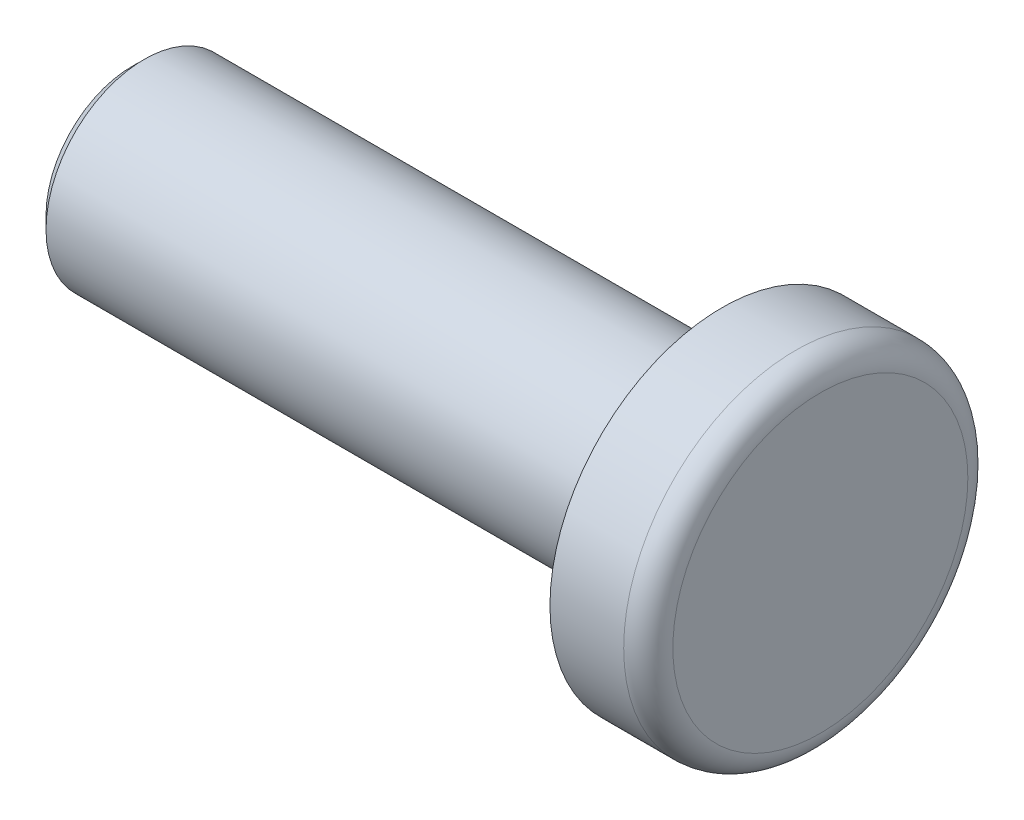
ISO-10303-21;
HEADER;
FILE_DESCRIPTION(('STEP AP214'),'2;1');
FILE_NAME('part.step','',(''),(''),'','','');
FILE_SCHEMA(('AUTOMOTIVE_DESIGN { 1 0 10303 214 1 1 1 1 }'));
ENDSEC;
DATA;
#1=APPLICATION_CONTEXT('core data for automotive mechanical design processes');
#2=APPLICATION_PROTOCOL_DEFINITION('international standard','automotive_design',2000,#1);
#3=PRODUCT_CONTEXT('',#1,'mechanical');
#4=PRODUCT('Part','Part','',(#3));
#5=PRODUCT_RELATED_PRODUCT_CATEGORY('part','',(#4));
#6=PRODUCT_DEFINITION_FORMATION('','',#4);
#7=PRODUCT_DEFINITION_CONTEXT('part definition',#1,'design');
#8=PRODUCT_DEFINITION('design','',#6,#7);
#9=PRODUCT_DEFINITION_SHAPE('','',#8);
#10=(LENGTH_UNIT() NAMED_UNIT(*) SI_UNIT(.MILLI.,.METRE.));
#11=(NAMED_UNIT(*) PLANE_ANGLE_UNIT() SI_UNIT($,.RADIAN.));
#12=(NAMED_UNIT(*) SI_UNIT($,.STERADIAN.) SOLID_ANGLE_UNIT());
#13=UNCERTAINTY_MEASURE_WITH_UNIT(LENGTH_MEASURE(1.E-05),#10,'distance_accuracy_value','');
#14=(GEOMETRIC_REPRESENTATION_CONTEXT(3) GLOBAL_UNCERTAINTY_ASSIGNED_CONTEXT((#13)) GLOBAL_UNIT_ASSIGNED_CONTEXT((#10,
#11,#12)) REPRESENTATION_CONTEXT('',''));
#15=CARTESIAN_POINT('',(0.,0.,0.));
#16=DIRECTION('',(0.,0.,1.));
#17=DIRECTION('',(1.,0.,0.));
#18=AXIS2_PLACEMENT_3D('',#15,#16,#17);
#19=CARTESIAN_POINT('',(0.,0.,0.));
#20=DIRECTION('',(1.,0.,0.));
#21=DIRECTION('',(0.,0.,-1.));
#22=AXIS2_PLACEMENT_3D('',#19,#20,#21);
#23=PLANE('',#22);
#24=CARTESIAN_POINT('',(0.,0.,0.));
#25=DIRECTION('',(1.,0.,0.));
#26=DIRECTION('',(0.,0.,-1.));
#27=AXIS2_PLACEMENT_3D('',#24,#25,#26);
#28=CIRCLE('',#27,3.5);
#29=CARTESIAN_POINT('',(0.,0.,-3.5));
#30=VERTEX_POINT('',#29);
#31=EDGE_CURVE('E52',#30,#30,#28,.T.);
#32=ORIENTED_EDGE('',*,*,#31,.F.);
#33=EDGE_LOOP('',(#32));
#34=FACE_BOUND('',#33,.T.);
#35=CARTESIAN_POINT('',(0.,0.,0.));
#36=DIRECTION('',(1.,0.,0.));
#37=DIRECTION('',(0.,0.,-1.));
#38=AXIS2_PLACEMENT_3D('',#35,#36,#37);
#39=CIRCLE('',#38,2.);
#40=CARTESIAN_POINT('',(0.,0.,-2.));
#41=VERTEX_POINT('',#40);
#42=EDGE_CURVE('E49',#41,#41,#39,.F.);
#43=ORIENTED_EDGE('',*,*,#42,.F.);
#44=EDGE_LOOP('',(#43));
#45=FACE_BOUND('',#44,.T.);
#46=ADVANCED_FACE('F29',(#34,#45),#23,.F.);
#47=CARTESIAN_POINT('',(2.,0.,0.));
#48=DIRECTION('',(-1.,0.,0.));
#49=DIRECTION('',(0.,0.,1.));
#50=AXIS2_PLACEMENT_3D('',#47,#48,#49);
#51=CYLINDRICAL_SURFACE('',#50,3.5);
#52=CARTESIAN_POINT('',(1.5,0.,0.));
#53=DIRECTION('',(1.,0.,0.));
#54=DIRECTION('',(0.,0.,-1.));
#55=AXIS2_PLACEMENT_3D('',#52,#53,#54);
#56=CIRCLE('',#55,3.5);
#57=CARTESIAN_POINT('',(1.5,0.,-3.5));
#58=VERTEX_POINT('',#57);
#59=EDGE_CURVE('E10',#58,#58,#56,.F.);
#60=ORIENTED_EDGE('',*,*,#59,.T.);
#61=EDGE_LOOP('',(#60));
#62=FACE_BOUND('',#61,.T.);
#63=ORIENTED_EDGE('',*,*,#31,.T.);
#64=EDGE_LOOP('',(#63));
#65=FACE_BOUND('',#64,.T.);
#66=ADVANCED_FACE('F56',(#62,#65),#51,.T.);
#67=CARTESIAN_POINT('',(2.,0.,0.));
#68=DIRECTION('',(1.,0.,0.));
#69=DIRECTION('',(0.,0.,-1.));
#70=AXIS2_PLACEMENT_3D('',#67,#68,#69);
#71=PLANE('',#70);
#72=CARTESIAN_POINT('',(2.,0.,0.));
#73=DIRECTION('',(1.,0.,0.));
#74=DIRECTION('',(0.,0.,-1.));
#75=AXIS2_PLACEMENT_3D('',#72,#73,#74);
#76=CIRCLE('',#75,3.);
#77=CARTESIAN_POINT('',(2.,0.,-3.));
#78=VERTEX_POINT('',#77);
#79=EDGE_CURVE('E36',#78,#78,#76,.T.);
#80=ORIENTED_EDGE('',*,*,#79,.T.);
#81=EDGE_LOOP('',(#80));
#82=FACE_BOUND('',#81,.T.);
#83=ADVANCED_FACE('F66',(#82),#71,.T.);
#84=CARTESIAN_POINT('',(-12.,0.,0.));
#85=DIRECTION('',(1.,0.,0.));
#86=DIRECTION('',(0.,0.,-1.));
#87=AXIS2_PLACEMENT_3D('',#84,#85,#86);
#88=CYLINDRICAL_SURFACE('',#87,2.);
#89=CARTESIAN_POINT('',(-11.75,0.,0.));
#90=DIRECTION('',(-1.,0.,0.));
#91=DIRECTION('',(0.,0.,1.));
#92=AXIS2_PLACEMENT_3D('',#89,#90,#91);
#93=CIRCLE('',#92,2.);
#94=CARTESIAN_POINT('',(-11.75,0.,2.));
#95=VERTEX_POINT('',#94);
#96=EDGE_CURVE('E40',#95,#95,#93,.F.);
#97=ORIENTED_EDGE('',*,*,#96,.T.);
#98=EDGE_LOOP('',(#97));
#99=FACE_BOUND('',#98,.T.);
#100=ORIENTED_EDGE('',*,*,#42,.T.);
#101=EDGE_LOOP('',(#100));
#102=FACE_BOUND('',#101,.T.);
#103=ADVANCED_FACE('F63',(#99,#102),#88,.T.);
#104=CARTESIAN_POINT('',(-12.,0.,0.));
#105=DIRECTION('',(-1.,0.,0.));
#106=DIRECTION('',(0.,0.,1.));
#107=AXIS2_PLACEMENT_3D('',#104,#105,#106);
#108=PLANE('',#107);
#109=CARTESIAN_POINT('',(-12.,0.,0.));
#110=DIRECTION('',(-1.,0.,0.));
#111=DIRECTION('',(0.,0.,1.));
#112=AXIS2_PLACEMENT_3D('',#109,#110,#111);
#113=CIRCLE('',#112,1.75);
#114=CARTESIAN_POINT('',(-12.,0.,1.75));
#115=VERTEX_POINT('',#114);
#116=EDGE_CURVE('E44',#115,#115,#113,.T.);
#117=ORIENTED_EDGE('',*,*,#116,.T.);
#118=EDGE_LOOP('',(#117));
#119=FACE_BOUND('',#118,.T.);
#120=ADVANCED_FACE('F65',(#119),#108,.T.);
#121=CARTESIAN_POINT('',(-12.,0.,0.));
#122=DIRECTION('',(1.,0.,0.));
#123=DIRECTION('',(0.,0.,-1.));
#124=AXIS2_PLACEMENT_3D('',#121,#122,#123);
#125=CONICAL_SURFACE('',#124,1.75,0.785398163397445);
#126=ORIENTED_EDGE('',*,*,#96,.F.);
#127=EDGE_LOOP('',(#126));
#128=FACE_BOUND('',#127,.T.);
#129=ORIENTED_EDGE('',*,*,#116,.F.);
#130=EDGE_LOOP('',(#129));
#131=FACE_BOUND('',#130,.T.);
#132=ADVANCED_FACE('F73',(#128,#131),#125,.T.);
#133=CARTESIAN_POINT('',(1.5,0.,0.));
#134=DIRECTION('',(1.,0.,0.));
#135=DIRECTION('',(0.,0.,-1.));
#136=AXIS2_PLACEMENT_3D('',#133,#134,#135);
#137=TOROIDAL_SURFACE('',#136,3.,0.5);
#138=ORIENTED_EDGE('',*,*,#59,.F.);
#139=EDGE_LOOP('',(#138));
#140=FACE_BOUND('',#139,.T.);
#141=ORIENTED_EDGE('',*,*,#79,.F.);
#142=EDGE_LOOP('',(#141));
#143=FACE_BOUND('',#142,.T.);
#144=ADVANCED_FACE('F31',(#140,#143),#137,.T.);
#145=CLOSED_SHELL('',(#46,#66,#83,#103,#120,#132,#144));
#146=MANIFOLD_SOLID_BREP('B2',#145);
#147=ADVANCED_BREP_SHAPE_REPRESENTATION('',(#18,#146),#14);
#148=SHAPE_DEFINITION_REPRESENTATION(#9,#147);
ENDSEC;
END-ISO-10303-21;
